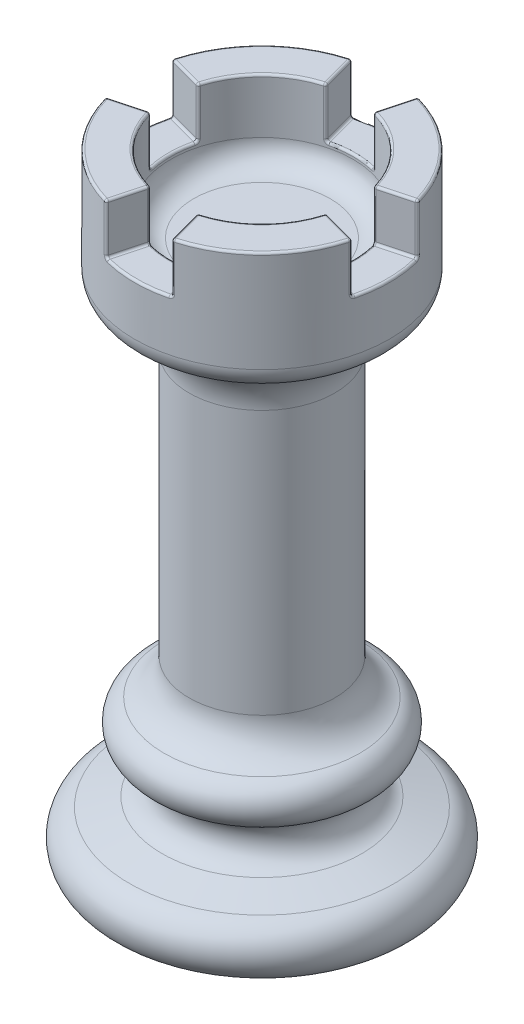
from build123d import *

# Parameters (mm, degrees)
CUT_EXTRUDE1_DEPTH = 5.588
CIRPATTERN1_COUNT  = 4
FILLET1_R          = 0.254


with BuildPart() as part:
    # Sketch1 → Base-Revolve (revolve)
    with BuildSketch(Plane.XY, mode=Mode.PRIVATE) as base_revolve_sk:
        with BuildLine():
            Line((0, 0), (13.97, 0))
            ThreePointArc((13.97, 0), (16.98904598, 2.628875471), (14.800286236, 5.980734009))
            Line((14.800286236, 5.980734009), (11.134368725, 7.018591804))
            ThreePointArc((11.134368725, 7.018591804), (9.288311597, 9.360815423), (10.940995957, 11.843268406))
            ThreePointArc((10.940995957, 11.843268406), (12.595677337, 14.238371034), (10.913999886, 16.614596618))
            ThreePointArc((10.913999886, 16.614596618), (8.894270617, 18.153887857), (8.128, 20.574952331))
            Line((8.128, 20.574952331), (8.128, 50.038952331))
            ThreePointArc((8.128, 50.038952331), (9.320379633, 53.660515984), (12.431058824, 55.865321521))
            ThreePointArc((12.431058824, 55.865321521), (13.727175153, 56.783990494), (14.224, 58.29297535))
            Line((14.224, 58.29297535), (14.224, 69.596))
            Line((14.224, 69.596), (10.16, 69.596))
            Line((10.16, 69.596), (10.16, 63.5))
            ThreePointArc((10.16, 63.5), (9.416051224, 61.703948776), (7.62, 60.96))
            Line((7.62, 60.96), (0, 60.96))
            Line((0, 60.96), (0, 0))
        make_face()
    revolve(base_revolve_sk.sketch.rotate(Axis((0, 0, 0), (0, 1, 0)), 90), axis=Axis((0, 0, 0), (0, 1, 0)))

    # Sketch2 → Cut-Extrude1 (cut)
    with BuildSketch(Plane(origin=(0, 69.596, 0), x_dir=(-1, 0, 0), z_dir=(0, 1, 0))):
        with BuildLine():
            Line((-9.813806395, -2.629601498), (-13.739328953, -3.681442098))
            ThreePointArc((-13.739328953, -3.681442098), (-14.224, 0), (-13.739328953, 3.681442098))
            Line((-13.739328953, 3.681442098), (-9.813806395, 2.629601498))
            ThreePointArc((-9.813806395, 2.629601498), (-10.16, 0), (-9.813806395, -2.629601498))
        make_face()
    cut_extrude1 = extrude(amount=-CUT_EXTRUDE1_DEPTH, mode=Mode.SUBTRACT)

    # CirPattern1: Cut-Extrude1 ×4 about axis
    cirpattern1_axis = Axis((0, 0, 0), (0, 1, 0))
    for i in range(1, CIRPATTERN1_COUNT):
        add(cut_extrude1.rotate(cirpattern1_axis, i * 360 / CIRPATTERN1_COUNT), mode=Mode.SUBTRACT)

    # Fillet1
    fillet1_edges = [part.edges().sort_by_distance(p)[0] for p in [
        (7.184204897, 69.596, 7.184204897),
        (10.057886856, 69.596, 10.057886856),
        (10.16, 64.008, 0),
        (9.813806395, 66.802, 2.629601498),
        (11.776567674, 64.008, -3.155521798),
        (9.813806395, 66.802, -2.629601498),
        (14.224, 64.008, 0),
        (13.739328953, 66.802, -3.681442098),
        (11.776567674, 64.008, 3.155521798),
        (13.739328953, 66.802, 3.681442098),
        (11.776567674, 69.596, 3.155521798),
        (11.776567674, 69.596, -3.155521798),
        (7.184204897, 69.596, -7.184204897),
        (10.057886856, 69.596, -10.057886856),
        (1.326146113, 64.008, -10.073079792),
        (2.629601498, 66.802, -9.813806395),
        (-3.155521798, 64.008, -11.776567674),
        (-2.629601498, 66.802, -9.813806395),
        (1.856604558, 64.008, -14.102311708),
        (-3.681442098, 66.802, -13.739328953),
        (3.155521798, 64.008, -11.776567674),
        (3.681442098, 66.802, -13.739328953),
        (3.155521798, 69.596, -11.776567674),
        (-3.155521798, 69.596, -11.776567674),
        (-7.184204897, 69.596, 7.184204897),
        (-7.184204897, 69.596, -7.184204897),
        (-10.057886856, 69.596, 10.057886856),
        (-10.057886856, 69.596, -10.057886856),
        (-10.16, 64.008, 0),
        (-9.813806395, 66.802, -2.629601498),
        (-11.776567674, 64.008, 3.155521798),
        (-9.813806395, 66.802, 2.629601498),
        (-14.224, 64.008, 0),
        (-13.739328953, 66.802, 3.681442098),
        (-11.776567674, 64.008, -3.155521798),
        (-13.739328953, 66.802, -3.681442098),
        (-11.776567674, 69.596, -3.155521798),
        (-11.776567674, 69.596, 3.155521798),
        (0, 64.008, 10.16),
        (-2.629601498, 66.802, 9.813806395),
        (3.155521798, 64.008, 11.776567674),
        (2.629601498, 66.802, 9.813806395),
        (0, 64.008, 14.224),
        (3.681442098, 66.802, 13.739328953),
        (-3.155521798, 64.008, 11.776567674),
        (-3.681442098, 66.802, 13.739328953),
        (-3.155521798, 69.596, 11.776567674),
        (3.155521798, 69.596, 11.776567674),
    ]]
    fillet(fillet1_edges, radius=FILLET1_R)


solid = part.part
